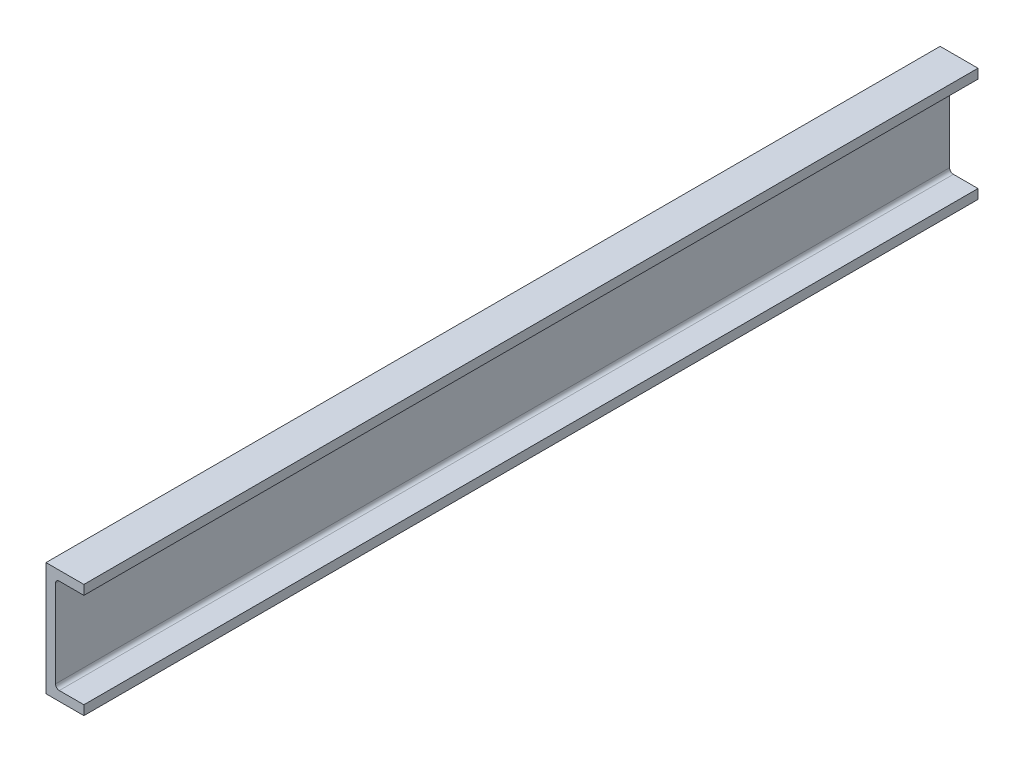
ISO-10303-21;
HEADER;
FILE_DESCRIPTION(('STEP AP214'),'2;1');
FILE_NAME('part.step','',(''),(''),'','','');
FILE_SCHEMA(('AUTOMOTIVE_DESIGN { 1 0 10303 214 1 1 1 1 }'));
ENDSEC;
DATA;
#1=APPLICATION_CONTEXT('core data for automotive mechanical design processes');
#2=APPLICATION_PROTOCOL_DEFINITION('international standard','automotive_design',2000,#1);
#3=PRODUCT_CONTEXT('',#1,'mechanical');
#4=PRODUCT('Part','Part','',(#3));
#5=PRODUCT_RELATED_PRODUCT_CATEGORY('part','',(#4));
#6=PRODUCT_DEFINITION_FORMATION('','',#4);
#7=PRODUCT_DEFINITION_CONTEXT('part definition',#1,'design');
#8=PRODUCT_DEFINITION('design','',#6,#7);
#9=PRODUCT_DEFINITION_SHAPE('','',#8);
#10=(LENGTH_UNIT() NAMED_UNIT(*) SI_UNIT(.MILLI.,.METRE.));
#11=(NAMED_UNIT(*) PLANE_ANGLE_UNIT() SI_UNIT($,.RADIAN.));
#12=(NAMED_UNIT(*) SI_UNIT($,.STERADIAN.) SOLID_ANGLE_UNIT());
#13=UNCERTAINTY_MEASURE_WITH_UNIT(LENGTH_MEASURE(1.E-05),#10,'distance_accuracy_value','');
#14=(GEOMETRIC_REPRESENTATION_CONTEXT(3) GLOBAL_UNCERTAINTY_ASSIGNED_CONTEXT((#13)) GLOBAL_UNIT_ASSIGNED_CONTEXT((#10,
#11,#12)) REPRESENTATION_CONTEXT('',''));
#15=CARTESIAN_POINT('',(0.,0.,0.));
#16=DIRECTION('',(0.,0.,1.));
#17=DIRECTION('',(1.,0.,0.));
#18=AXIS2_PLACEMENT_3D('',#15,#16,#17);
#19=CARTESIAN_POINT('',(25.4,0.,-599.44));
#20=DIRECTION('',(0.,-1.,0.));
#21=DIRECTION('',(1.,0.,0.));
#22=AXIS2_PLACEMENT_3D('',#19,#20,#21);
#23=PLANE('',#22);
#24=DIRECTION('',(1.,0.,0.));
#25=VECTOR('',#24,1.);
#26=CARTESIAN_POINT('',(25.4,0.,0.));
#27=LINE('',#26,#25);
#28=CARTESIAN_POINT('',(0.,0.,0.));
#29=VERTEX_POINT('',#28);
#30=CARTESIAN_POINT('',(25.4,0.,0.));
#31=VERTEX_POINT('',#30);
#32=EDGE_CURVE('E150',#29,#31,#27,.T.);
#33=ORIENTED_EDGE('',*,*,#32,.F.);
#34=DIRECTION('',(0.,0.,1.));
#35=VECTOR('',#34,1.);
#36=CARTESIAN_POINT('',(0.,0.,-599.44));
#37=LINE('',#36,#35);
#38=CARTESIAN_POINT('',(0.,0.,-599.44));
#39=VERTEX_POINT('',#38);
#40=EDGE_CURVE('E130',#39,#29,#37,.T.);
#41=ORIENTED_EDGE('',*,*,#40,.F.);
#42=DIRECTION('',(1.,0.,0.));
#43=VECTOR('',#42,1.);
#44=CARTESIAN_POINT('',(25.4,0.,-599.44));
#45=LINE('',#44,#43);
#46=CARTESIAN_POINT('',(25.4,0.,-599.44));
#47=VERTEX_POINT('',#46);
#48=EDGE_CURVE('E125',#39,#47,#45,.T.);
#49=ORIENTED_EDGE('',*,*,#48,.T.);
#50=DIRECTION('',(0.,0.,1.));
#51=VECTOR('',#50,1.);
#52=CARTESIAN_POINT('',(25.4,0.,-599.44));
#53=LINE('',#52,#51);
#54=EDGE_CURVE('E107',#47,#31,#53,.T.);
#55=ORIENTED_EDGE('',*,*,#54,.T.);
#56=EDGE_LOOP('',(#33,#41,#49,#55));
#57=FACE_BOUND('',#56,.T.);
#58=ADVANCED_FACE('F32',(#57),#23,.T.);
#59=CARTESIAN_POINT('',(0.,0.,-599.44));
#60=DIRECTION('',(-1.,0.,0.));
#61=DIRECTION('',(0.,0.,1.));
#62=AXIS2_PLACEMENT_3D('',#59,#60,#61);
#63=PLANE('',#62);
#64=DIRECTION('',(0.,-1.,0.));
#65=VECTOR('',#64,1.);
#66=CARTESIAN_POINT('',(0.,0.,0.));
#67=LINE('',#66,#65);
#68=CARTESIAN_POINT('',(0.,76.2,0.));
#69=VERTEX_POINT('',#68);
#70=EDGE_CURVE('E131',#69,#29,#67,.T.);
#71=ORIENTED_EDGE('',*,*,#70,.F.);
#72=DIRECTION('',(0.,0.,1.));
#73=VECTOR('',#72,1.);
#74=CARTESIAN_POINT('',(0.,76.2,-599.44));
#75=LINE('',#74,#73);
#76=CARTESIAN_POINT('',(0.,76.2,-599.44));
#77=VERTEX_POINT('',#76);
#78=EDGE_CURVE('E167',#77,#69,#75,.T.);
#79=ORIENTED_EDGE('',*,*,#78,.F.);
#80=DIRECTION('',(0.,-1.,0.));
#81=VECTOR('',#80,1.);
#82=CARTESIAN_POINT('',(0.,0.,-599.44));
#83=LINE('',#82,#81);
#84=EDGE_CURVE('E118',#77,#39,#83,.T.);
#85=ORIENTED_EDGE('',*,*,#84,.T.);
#86=ORIENTED_EDGE('',*,*,#40,.T.);
#87=EDGE_LOOP('',(#71,#79,#85,#86));
#88=FACE_BOUND('',#87,.T.);
#89=ADVANCED_FACE('F213',(#88),#63,.T.);
#90=CARTESIAN_POINT('',(0.,76.2,-599.44));
#91=DIRECTION('',(0.,1.,0.));
#92=DIRECTION('',(0.,0.,1.));
#93=AXIS2_PLACEMENT_3D('',#90,#91,#92);
#94=PLANE('',#93);
#95=DIRECTION('',(-1.,0.,0.));
#96=VECTOR('',#95,1.);
#97=CARTESIAN_POINT('',(0.,76.2,0.));
#98=LINE('',#97,#96);
#99=CARTESIAN_POINT('',(25.4,76.2,0.));
#100=VERTEX_POINT('',#99);
#101=EDGE_CURVE('E134',#100,#69,#98,.T.);
#102=ORIENTED_EDGE('',*,*,#101,.F.);
#103=DIRECTION('',(0.,0.,1.));
#104=VECTOR('',#103,1.);
#105=CARTESIAN_POINT('',(25.4,76.2,-599.44));
#106=LINE('',#105,#104);
#107=CARTESIAN_POINT('',(25.4,76.2,-599.44));
#108=VERTEX_POINT('',#107);
#109=EDGE_CURVE('E169',#108,#100,#106,.T.);
#110=ORIENTED_EDGE('',*,*,#109,.F.);
#111=DIRECTION('',(-1.,0.,0.));
#112=VECTOR('',#111,1.);
#113=CARTESIAN_POINT('',(0.,76.2,-599.44));
#114=LINE('',#113,#112);
#115=EDGE_CURVE('E146',#108,#77,#114,.T.);
#116=ORIENTED_EDGE('',*,*,#115,.T.);
#117=ORIENTED_EDGE('',*,*,#78,.T.);
#118=EDGE_LOOP('',(#102,#110,#116,#117));
#119=FACE_BOUND('',#118,.T.);
#120=ADVANCED_FACE('F214',(#119),#94,.T.);
#121=CARTESIAN_POINT('',(25.4,76.2,-599.44));
#122=DIRECTION('',(1.,0.,0.));
#123=DIRECTION('',(0.,1.,0.));
#124=AXIS2_PLACEMENT_3D('',#121,#122,#123);
#125=PLANE('',#124);
#126=DIRECTION('',(0.,1.,0.));
#127=VECTOR('',#126,1.);
#128=CARTESIAN_POINT('',(25.4,76.2,0.));
#129=LINE('',#128,#127);
#130=CARTESIAN_POINT('',(25.4,69.85,0.));
#131=VERTEX_POINT('',#130);
#132=EDGE_CURVE('E160',#131,#100,#129,.T.);
#133=ORIENTED_EDGE('',*,*,#132,.F.);
#134=DIRECTION('',(0.,0.,1.));
#135=VECTOR('',#134,1.);
#136=CARTESIAN_POINT('',(25.4,69.85,-599.44));
#137=LINE('',#136,#135);
#138=CARTESIAN_POINT('',(25.4,69.85,-599.44));
#139=VERTEX_POINT('',#138);
#140=EDGE_CURVE('E171',#139,#131,#137,.T.);
#141=ORIENTED_EDGE('',*,*,#140,.F.);
#142=DIRECTION('',(0.,1.,0.));
#143=VECTOR('',#142,1.);
#144=CARTESIAN_POINT('',(25.4,76.2,-599.44));
#145=LINE('',#144,#143);
#146=EDGE_CURVE('E143',#139,#108,#145,.T.);
#147=ORIENTED_EDGE('',*,*,#146,.T.);
#148=ORIENTED_EDGE('',*,*,#109,.T.);
#149=EDGE_LOOP('',(#133,#141,#147,#148));
#150=FACE_BOUND('',#149,.T.);
#151=ADVANCED_FACE('F208',(#150),#125,.T.);
#152=CARTESIAN_POINT('',(25.4,69.85,-599.44));
#153=DIRECTION('',(0.,-1.,0.));
#154=DIRECTION('',(0.,0.,-1.));
#155=AXIS2_PLACEMENT_3D('',#152,#153,#154);
#156=PLANE('',#155);
#157=DIRECTION('',(1.,0.,0.));
#158=VECTOR('',#157,1.);
#159=CARTESIAN_POINT('',(25.4,69.85,0.));
#160=LINE('',#159,#158);
#161=CARTESIAN_POINT('',(8.88999999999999,69.85,0.));
#162=VERTEX_POINT('',#161);
#163=EDGE_CURVE('E158',#162,#131,#160,.T.);
#164=ORIENTED_EDGE('',*,*,#163,.F.);
#165=DIRECTION('',(0.,0.,1.));
#166=VECTOR('',#165,1.);
#167=CARTESIAN_POINT('',(8.88999999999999,69.85,-599.44));
#168=LINE('',#167,#166);
#169=CARTESIAN_POINT('',(8.88999999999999,69.85,-599.44));
#170=VERTEX_POINT('',#169);
#171=EDGE_CURVE('E47',#162,#170,#168,.F.);
#172=ORIENTED_EDGE('',*,*,#171,.T.);
#173=DIRECTION('',(1.,0.,0.));
#174=VECTOR('',#173,1.);
#175=CARTESIAN_POINT('',(25.4,69.85,-599.44));
#176=LINE('',#175,#174);
#177=EDGE_CURVE('E141',#170,#139,#176,.T.);
#178=ORIENTED_EDGE('',*,*,#177,.T.);
#179=ORIENTED_EDGE('',*,*,#140,.T.);
#180=EDGE_LOOP('',(#164,#172,#178,#179));
#181=FACE_BOUND('',#180,.T.);
#182=ADVANCED_FACE('F205',(#181),#156,.T.);
#183=CARTESIAN_POINT('',(6.34999999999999,69.85,-599.44));
#184=DIRECTION('',(1.,0.,0.));
#185=DIRECTION('',(0.,1.,0.));
#186=AXIS2_PLACEMENT_3D('',#183,#184,#185);
#187=PLANE('',#186);
#188=DIRECTION('',(0.,1.,0.));
#189=VECTOR('',#188,1.);
#190=CARTESIAN_POINT('',(6.34999999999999,69.85,0.));
#191=LINE('',#190,#189);
#192=CARTESIAN_POINT('',(6.35,8.89,0.));
#193=VERTEX_POINT('',#192);
#194=CARTESIAN_POINT('',(6.34999999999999,67.31,0.));
#195=VERTEX_POINT('',#194);
#196=EDGE_CURVE('E156',#193,#195,#191,.T.);
#197=ORIENTED_EDGE('',*,*,#196,.F.);
#198=DIRECTION('',(0.,0.,1.));
#199=VECTOR('',#198,1.);
#200=CARTESIAN_POINT('',(6.35,8.89,-599.44));
#201=LINE('',#200,#199);
#202=CARTESIAN_POINT('',(6.35,8.89,-599.44));
#203=VERTEX_POINT('',#202);
#204=EDGE_CURVE('E180',#193,#203,#201,.F.);
#205=ORIENTED_EDGE('',*,*,#204,.T.);
#206=DIRECTION('',(0.,1.,0.));
#207=VECTOR('',#206,1.);
#208=CARTESIAN_POINT('',(6.34999999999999,69.85,-599.44));
#209=LINE('',#208,#207);
#210=CARTESIAN_POINT('',(6.34999999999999,67.31,-599.44));
#211=VERTEX_POINT('',#210);
#212=EDGE_CURVE('E138',#203,#211,#209,.T.);
#213=ORIENTED_EDGE('',*,*,#212,.T.);
#214=DIRECTION('',(0.,0.,1.));
#215=VECTOR('',#214,1.);
#216=CARTESIAN_POINT('',(6.34999999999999,67.31,0.));
#217=LINE('',#216,#215);
#218=EDGE_CURVE('E177',#211,#195,#217,.T.);
#219=ORIENTED_EDGE('',*,*,#218,.T.);
#220=EDGE_LOOP('',(#197,#205,#213,#219));
#221=FACE_BOUND('',#220,.T.);
#222=ADVANCED_FACE('F198',(#221),#187,.T.);
#223=CARTESIAN_POINT('',(6.35,6.35,-599.44));
#224=DIRECTION('',(0.,1.,0.));
#225=DIRECTION('',(-1.,0.,0.));
#226=AXIS2_PLACEMENT_3D('',#223,#224,#225);
#227=PLANE('',#226);
#228=DIRECTION('',(-1.,0.,0.));
#229=VECTOR('',#228,1.);
#230=CARTESIAN_POINT('',(6.35,6.35,-599.44));
#231=LINE('',#230,#229);
#232=CARTESIAN_POINT('',(25.4,6.35,-599.44));
#233=VERTEX_POINT('',#232);
#234=CARTESIAN_POINT('',(8.89,6.35,-599.44));
#235=VERTEX_POINT('',#234);
#236=EDGE_CURVE('E128',#233,#235,#231,.T.);
#237=ORIENTED_EDGE('',*,*,#236,.T.);
#238=DIRECTION('',(0.,0.,1.));
#239=VECTOR('',#238,1.);
#240=CARTESIAN_POINT('',(8.89,6.35,0.));
#241=LINE('',#240,#239);
#242=CARTESIAN_POINT('',(8.89,6.35,0.));
#243=VERTEX_POINT('',#242);
#244=EDGE_CURVE('E166',#235,#243,#241,.T.);
#245=ORIENTED_EDGE('',*,*,#244,.T.);
#246=DIRECTION('',(-1.,0.,0.));
#247=VECTOR('',#246,1.);
#248=CARTESIAN_POINT('',(6.35,6.35,0.));
#249=LINE('',#248,#247);
#250=CARTESIAN_POINT('',(25.4,6.35,0.));
#251=VERTEX_POINT('',#250);
#252=EDGE_CURVE('E153',#251,#243,#249,.T.);
#253=ORIENTED_EDGE('',*,*,#252,.F.);
#254=DIRECTION('',(0.,0.,1.));
#255=VECTOR('',#254,1.);
#256=CARTESIAN_POINT('',(25.4,6.35,-599.44));
#257=LINE('',#256,#255);
#258=EDGE_CURVE('E117',#233,#251,#257,.T.);
#259=ORIENTED_EDGE('',*,*,#258,.F.);
#260=EDGE_LOOP('',(#237,#245,#253,#259));
#261=FACE_BOUND('',#260,.T.);
#262=ADVANCED_FACE('F192',(#261),#227,.T.);
#263=CARTESIAN_POINT('',(25.4,6.35,-599.44));
#264=DIRECTION('',(1.,0.,0.));
#265=DIRECTION('',(0.,0.,-1.));
#266=AXIS2_PLACEMENT_3D('',#263,#264,#265);
#267=PLANE('',#266);
#268=DIRECTION('',(0.,1.,0.));
#269=VECTOR('',#268,1.);
#270=CARTESIAN_POINT('',(25.4,6.35,0.));
#271=LINE('',#270,#269);
#272=EDGE_CURVE('E112',#31,#251,#271,.T.);
#273=ORIENTED_EDGE('',*,*,#272,.F.);
#274=ORIENTED_EDGE('',*,*,#54,.F.);
#275=DIRECTION('',(0.,1.,0.));
#276=VECTOR('',#275,1.);
#277=CARTESIAN_POINT('',(25.4,6.35,-599.44));
#278=LINE('',#277,#276);
#279=EDGE_CURVE('E110',#47,#233,#278,.T.);
#280=ORIENTED_EDGE('',*,*,#279,.T.);
#281=ORIENTED_EDGE('',*,*,#258,.T.);
#282=EDGE_LOOP('',(#273,#274,#280,#281));
#283=FACE_BOUND('',#282,.T.);
#284=ADVANCED_FACE('F109',(#283),#267,.T.);
#285=CARTESIAN_POINT('',(0.,0.,-599.44));
#286=DIRECTION('',(0.,0.,-1.));
#287=DIRECTION('',(-1.,0.,0.));
#288=AXIS2_PLACEMENT_3D('',#285,#286,#287);
#289=PLANE('',#288);
#290=ORIENTED_EDGE('',*,*,#48,.F.);
#291=ORIENTED_EDGE('',*,*,#84,.F.);
#292=ORIENTED_EDGE('',*,*,#115,.F.);
#293=ORIENTED_EDGE('',*,*,#146,.F.);
#294=ORIENTED_EDGE('',*,*,#177,.F.);
#295=CARTESIAN_POINT('',(8.88999999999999,67.31,-599.44));
#296=DIRECTION('',(0.,0.,-1.));
#297=DIRECTION('',(-1.,0.,0.));
#298=AXIS2_PLACEMENT_3D('',#295,#296,#297);
#299=CIRCLE('',#298,2.54);
#300=EDGE_CURVE('E11',#170,#211,#299,.F.);
#301=ORIENTED_EDGE('',*,*,#300,.T.);
#302=ORIENTED_EDGE('',*,*,#212,.F.);
#303=CARTESIAN_POINT('',(8.89,8.89,-599.44));
#304=DIRECTION('',(0.,0.,-1.));
#305=DIRECTION('',(-1.,0.,0.));
#306=AXIS2_PLACEMENT_3D('',#303,#304,#305);
#307=CIRCLE('',#306,2.54);
#308=EDGE_CURVE('E185',#203,#235,#307,.F.);
#309=ORIENTED_EDGE('',*,*,#308,.T.);
#310=ORIENTED_EDGE('',*,*,#236,.F.);
#311=ORIENTED_EDGE('',*,*,#279,.F.);
#312=EDGE_LOOP('',(#290,#291,#292,#293,#294,#301,#302,#309,#310,#311));
#313=FACE_BOUND('',#312,.T.);
#314=ADVANCED_FACE('F123',(#313),#289,.T.);
#315=CARTESIAN_POINT('',(0.,0.,0.));
#316=DIRECTION('',(0.,0.,-1.));
#317=DIRECTION('',(-1.,0.,0.));
#318=AXIS2_PLACEMENT_3D('',#315,#316,#317);
#319=PLANE('',#318);
#320=ORIENTED_EDGE('',*,*,#32,.T.);
#321=ORIENTED_EDGE('',*,*,#272,.T.);
#322=ORIENTED_EDGE('',*,*,#252,.T.);
#323=CARTESIAN_POINT('',(8.89,8.89,0.));
#324=DIRECTION('',(0.,0.,-1.));
#325=DIRECTION('',(-1.,0.,0.));
#326=AXIS2_PLACEMENT_3D('',#323,#324,#325);
#327=CIRCLE('',#326,2.54);
#328=EDGE_CURVE('E183',#243,#193,#327,.T.);
#329=ORIENTED_EDGE('',*,*,#328,.T.);
#330=ORIENTED_EDGE('',*,*,#196,.T.);
#331=CARTESIAN_POINT('',(8.88999999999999,67.31,0.));
#332=DIRECTION('',(0.,0.,-1.));
#333=DIRECTION('',(-1.,0.,0.));
#334=AXIS2_PLACEMENT_3D('',#331,#332,#333);
#335=CIRCLE('',#334,2.54);
#336=EDGE_CURVE('E40',#195,#162,#335,.T.);
#337=ORIENTED_EDGE('',*,*,#336,.T.);
#338=ORIENTED_EDGE('',*,*,#163,.T.);
#339=ORIENTED_EDGE('',*,*,#132,.T.);
#340=ORIENTED_EDGE('',*,*,#101,.T.);
#341=ORIENTED_EDGE('',*,*,#70,.T.);
#342=EDGE_LOOP('',(#320,#321,#322,#329,#330,#337,#338,#339,#340,#341));
#343=FACE_BOUND('',#342,.T.);
#344=ADVANCED_FACE('F196',(#343),#319,.F.);
#345=CARTESIAN_POINT('',(8.89,8.89,-599.44));
#346=DIRECTION('',(0.,0.,-1.));
#347=DIRECTION('',(-1.,0.,0.));
#348=AXIS2_PLACEMENT_3D('',#345,#346,#347);
#349=CYLINDRICAL_SURFACE('',#348,2.54);
#350=ORIENTED_EDGE('',*,*,#308,.F.);
#351=ORIENTED_EDGE('',*,*,#204,.F.);
#352=ORIENTED_EDGE('',*,*,#328,.F.);
#353=ORIENTED_EDGE('',*,*,#244,.F.);
#354=EDGE_LOOP('',(#350,#351,#352,#353));
#355=FACE_BOUND('',#354,.T.);
#356=ADVANCED_FACE('F194',(#355),#349,.F.);
#357=CARTESIAN_POINT('',(8.88999999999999,67.31,-599.44));
#358=DIRECTION('',(0.,0.,-1.));
#359=DIRECTION('',(-1.,0.,0.));
#360=AXIS2_PLACEMENT_3D('',#357,#358,#359);
#361=CYLINDRICAL_SURFACE('',#360,2.54);
#362=ORIENTED_EDGE('',*,*,#300,.F.);
#363=ORIENTED_EDGE('',*,*,#171,.F.);
#364=ORIENTED_EDGE('',*,*,#336,.F.);
#365=ORIENTED_EDGE('',*,*,#218,.F.);
#366=EDGE_LOOP('',(#362,#363,#364,#365));
#367=FACE_BOUND('',#366,.T.);
#368=ADVANCED_FACE('F34',(#367),#361,.F.);
#369=CLOSED_SHELL('',(#58,#89,#120,#151,#182,#222,#262,#284,#314,#344,#356,#368));
#370=MANIFOLD_SOLID_BREP('B2',#369);
#371=ADVANCED_BREP_SHAPE_REPRESENTATION('',(#18,#370),#14);
#372=SHAPE_DEFINITION_REPRESENTATION(#9,#371);
ENDSEC;
END-ISO-10303-21;
